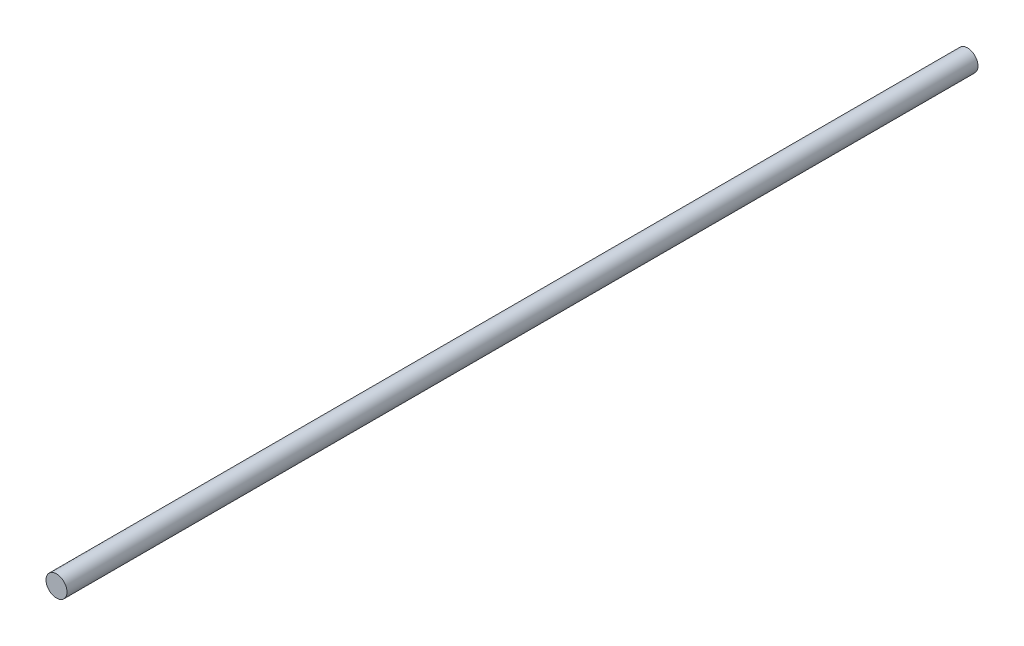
ISO-10303-21;
HEADER;
FILE_DESCRIPTION(('STEP AP214'),'2;1');
FILE_NAME('part.step','',(''),(''),'','','');
FILE_SCHEMA(('AUTOMOTIVE_DESIGN { 1 0 10303 214 1 1 1 1 }'));
ENDSEC;
DATA;
#1=APPLICATION_CONTEXT('core data for automotive mechanical design processes');
#2=APPLICATION_PROTOCOL_DEFINITION('international standard','automotive_design',2000,#1);
#3=PRODUCT_CONTEXT('',#1,'mechanical');
#4=PRODUCT('Part','Part','',(#3));
#5=PRODUCT_RELATED_PRODUCT_CATEGORY('part','',(#4));
#6=PRODUCT_DEFINITION_FORMATION('','',#4);
#7=PRODUCT_DEFINITION_CONTEXT('part definition',#1,'design');
#8=PRODUCT_DEFINITION('design','',#6,#7);
#9=PRODUCT_DEFINITION_SHAPE('','',#8);
#10=(LENGTH_UNIT() NAMED_UNIT(*) SI_UNIT(.MILLI.,.METRE.));
#11=(NAMED_UNIT(*) PLANE_ANGLE_UNIT() SI_UNIT($,.RADIAN.));
#12=(NAMED_UNIT(*) SI_UNIT($,.STERADIAN.) SOLID_ANGLE_UNIT());
#13=UNCERTAINTY_MEASURE_WITH_UNIT(LENGTH_MEASURE(1.E-05),#10,'distance_accuracy_value','');
#14=(GEOMETRIC_REPRESENTATION_CONTEXT(3) GLOBAL_UNCERTAINTY_ASSIGNED_CONTEXT((#13)) GLOBAL_UNIT_ASSIGNED_CONTEXT((#10,
#11,#12)) REPRESENTATION_CONTEXT('',''));
#15=CARTESIAN_POINT('',(0.,0.,0.));
#16=DIRECTION('',(0.,0.,1.));
#17=DIRECTION('',(1.,0.,0.));
#18=AXIS2_PLACEMENT_3D('',#15,#16,#17);
#19=CARTESIAN_POINT('',(0.,0.,-2600.));
#20=DIRECTION('',(0.,0.,1.));
#21=DIRECTION('',(1.,0.,0.));
#22=AXIS2_PLACEMENT_3D('',#19,#20,#21);
#23=CYLINDRICAL_SURFACE('',#22,30.);
#24=CARTESIAN_POINT('',(0.,0.,-2600.));
#25=DIRECTION('',(0.,0.,1.));
#26=DIRECTION('',(1.,0.,0.));
#27=AXIS2_PLACEMENT_3D('',#24,#25,#26);
#28=CIRCLE('',#27,30.);
#29=CARTESIAN_POINT('',(30.,0.,-2600.));
#30=VERTEX_POINT('',#29);
#31=EDGE_CURVE('E10',#30,#30,#28,.T.);
#32=ORIENTED_EDGE('',*,*,#31,.T.);
#33=EDGE_LOOP('',(#32));
#34=FACE_BOUND('',#33,.T.);
#35=CARTESIAN_POINT('',(0.,0.,0.));
#36=DIRECTION('',(0.,0.,1.));
#37=DIRECTION('',(1.,0.,0.));
#38=AXIS2_PLACEMENT_3D('',#35,#36,#37);
#39=CIRCLE('',#38,30.);
#40=CARTESIAN_POINT('',(30.,0.,0.));
#41=VERTEX_POINT('',#40);
#42=EDGE_CURVE('E40',#41,#41,#39,.T.);
#43=ORIENTED_EDGE('',*,*,#42,.F.);
#44=EDGE_LOOP('',(#43));
#45=FACE_BOUND('',#44,.T.);
#46=ADVANCED_FACE('F37',(#34,#45),#23,.T.);
#47=CARTESIAN_POINT('',(0.,0.,-2600.));
#48=DIRECTION('',(0.,0.,1.));
#49=DIRECTION('',(1.,0.,0.));
#50=AXIS2_PLACEMENT_3D('',#47,#48,#49);
#51=PLANE('',#50);
#52=ORIENTED_EDGE('',*,*,#31,.F.);
#53=EDGE_LOOP('',(#52));
#54=FACE_BOUND('',#53,.T.);
#55=ADVANCED_FACE('F54',(#54),#51,.F.);
#56=CARTESIAN_POINT('',(0.,0.,0.));
#57=DIRECTION('',(0.,0.,1.));
#58=DIRECTION('',(1.,0.,0.));
#59=AXIS2_PLACEMENT_3D('',#56,#57,#58);
#60=PLANE('',#59);
#61=ORIENTED_EDGE('',*,*,#42,.T.);
#62=EDGE_LOOP('',(#61));
#63=FACE_BOUND('',#62,.T.);
#64=ADVANCED_FACE('F51',(#63),#60,.T.);
#65=CLOSED_SHELL('',(#46,#55,#64));
#66=MANIFOLD_SOLID_BREP('B2',#65);
#67=ADVANCED_BREP_SHAPE_REPRESENTATION('',(#18,#66),#14);
#68=SHAPE_DEFINITION_REPRESENTATION(#9,#67);
ENDSEC;
END-ISO-10303-21;
